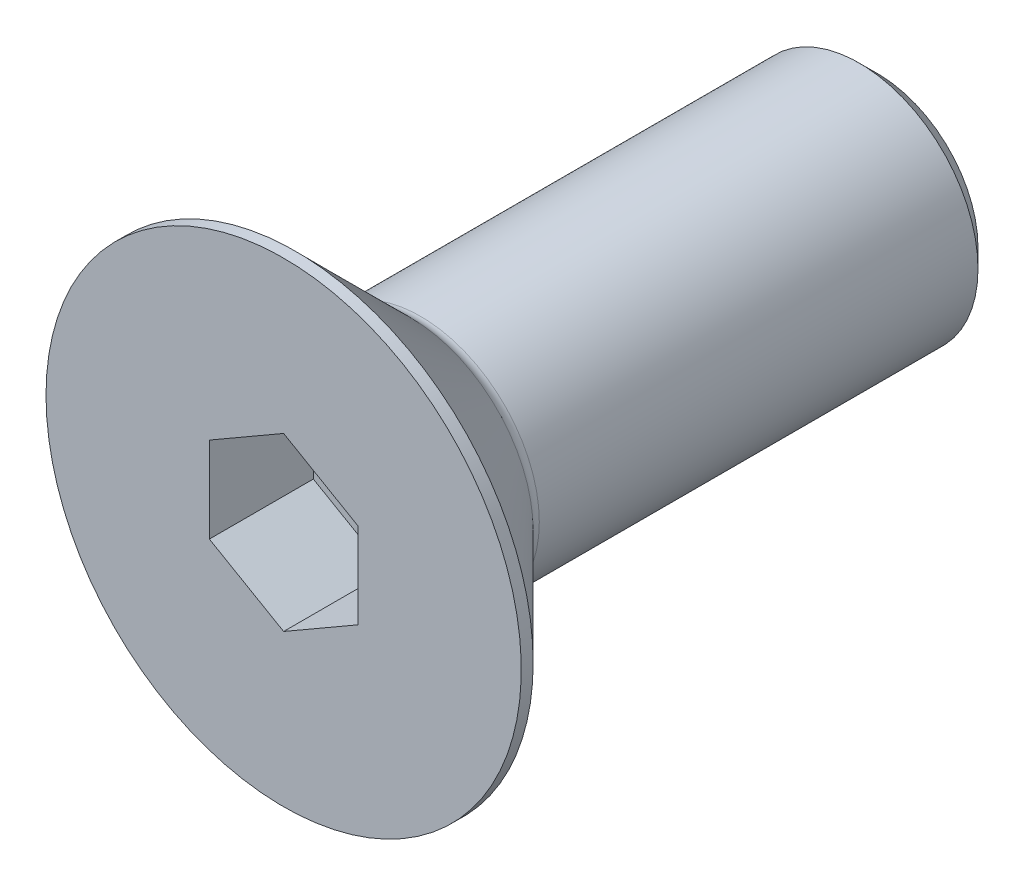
ISO-10303-21;
HEADER;
FILE_DESCRIPTION(('STEP AP214'),'2;1');
FILE_NAME('part.step','',(''),(''),'','','');
FILE_SCHEMA(('AUTOMOTIVE_DESIGN { 1 0 10303 214 1 1 1 1 }'));
ENDSEC;
DATA;
#1=APPLICATION_CONTEXT('core data for automotive mechanical design processes');
#2=APPLICATION_PROTOCOL_DEFINITION('international standard','automotive_design',2000,#1);
#3=PRODUCT_CONTEXT('',#1,'mechanical');
#4=PRODUCT('Part','Part','',(#3));
#5=PRODUCT_RELATED_PRODUCT_CATEGORY('part','',(#4));
#6=PRODUCT_DEFINITION_FORMATION('','',#4);
#7=PRODUCT_DEFINITION_CONTEXT('part definition',#1,'design');
#8=PRODUCT_DEFINITION('design','',#6,#7);
#9=PRODUCT_DEFINITION_SHAPE('','',#8);
#10=(LENGTH_UNIT() NAMED_UNIT(*) SI_UNIT(.MILLI.,.METRE.));
#11=(NAMED_UNIT(*) PLANE_ANGLE_UNIT() SI_UNIT($,.RADIAN.));
#12=(NAMED_UNIT(*) SI_UNIT($,.STERADIAN.) SOLID_ANGLE_UNIT());
#13=UNCERTAINTY_MEASURE_WITH_UNIT(LENGTH_MEASURE(1.E-05),#10,'distance_accuracy_value','');
#14=(GEOMETRIC_REPRESENTATION_CONTEXT(3) GLOBAL_UNCERTAINTY_ASSIGNED_CONTEXT((#13)) GLOBAL_UNIT_ASSIGNED_CONTEXT((#10,
#11,#12)) REPRESENTATION_CONTEXT('',''));
#15=CARTESIAN_POINT('',(0.,0.,0.));
#16=DIRECTION('',(0.,0.,1.));
#17=DIRECTION('',(1.,0.,0.));
#18=AXIS2_PLACEMENT_3D('',#15,#16,#17);
#19=CARTESIAN_POINT('',(0.,0.,-3.5));
#20=DIRECTION('',(0.,0.,1.));
#21=DIRECTION('',(1.,0.,0.));
#22=AXIS2_PLACEMENT_3D('',#19,#20,#21);
#23=PLANE('',#22);
#24=DIRECTION('',(-0.866025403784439,-0.5,0.));
#25=VECTOR('',#24,1.);
#26=CARTESIAN_POINT('',(0.,2.88675134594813,-3.5));
#27=LINE('',#26,#25);
#28=CARTESIAN_POINT('',(0.,2.88675134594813,-3.5));
#29=VERTEX_POINT('',#28);
#30=CARTESIAN_POINT('',(-2.5,1.44337567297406,-3.5));
#31=VERTEX_POINT('',#30);
#32=EDGE_CURVE('E83',#29,#31,#27,.T.);
#33=ORIENTED_EDGE('',*,*,#32,.T.);
#34=DIRECTION('',(0.,1.,0.));
#35=VECTOR('',#34,1.);
#36=CARTESIAN_POINT('',(-2.5,1.44337567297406,-3.5));
#37=LINE('',#36,#35);
#38=CARTESIAN_POINT('',(-2.5,-1.44337567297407,-3.5));
#39=VERTEX_POINT('',#38);
#40=EDGE_CURVE('E67',#31,#39,#37,.F.);
#41=ORIENTED_EDGE('',*,*,#40,.T.);
#42=DIRECTION('',(0.866025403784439,-0.499999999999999,0.));
#43=VECTOR('',#42,1.);
#44=CARTESIAN_POINT('',(-2.5,-1.44337567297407,-3.5));
#45=LINE('',#44,#43);
#46=CARTESIAN_POINT('',(0.,-2.88675134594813,-3.5));
#47=VERTEX_POINT('',#46);
#48=EDGE_CURVE('E72',#39,#47,#45,.T.);
#49=ORIENTED_EDGE('',*,*,#48,.T.);
#50=DIRECTION('',(0.866025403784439,0.5,0.));
#51=VECTOR('',#50,1.);
#52=CARTESIAN_POINT('',(0.,-2.88675134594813,-3.5));
#53=LINE('',#52,#51);
#54=CARTESIAN_POINT('',(2.5,-1.44337567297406,-3.5));
#55=VERTEX_POINT('',#54);
#56=EDGE_CURVE('E129',#47,#55,#53,.T.);
#57=ORIENTED_EDGE('',*,*,#56,.T.);
#58=DIRECTION('',(0.,1.,0.));
#59=VECTOR('',#58,1.);
#60=CARTESIAN_POINT('',(2.5,-1.44337567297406,-3.5));
#61=LINE('',#60,#59);
#62=CARTESIAN_POINT('',(2.5,1.44337567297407,-3.5));
#63=VERTEX_POINT('',#62);
#64=EDGE_CURVE('E133',#55,#63,#61,.T.);
#65=ORIENTED_EDGE('',*,*,#64,.T.);
#66=DIRECTION('',(-0.866025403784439,0.499999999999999,0.));
#67=VECTOR('',#66,1.);
#68=CARTESIAN_POINT('',(2.5,1.44337567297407,-3.5));
#69=LINE('',#68,#67);
#70=EDGE_CURVE('E138',#63,#29,#69,.T.);
#71=ORIENTED_EDGE('',*,*,#70,.T.);
#72=EDGE_LOOP('',(#33,#41,#49,#57,#65,#71));
#73=FACE_BOUND('',#72,.T.);
#74=ADVANCED_FACE('F16',(#73),#23,.T.);
#75=CARTESIAN_POINT('',(-2.5,-1.44337567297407,0.));
#76=DIRECTION('',(-0.499999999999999,-0.866025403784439,0.));
#77=DIRECTION('',(0.866025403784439,-0.499999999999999,0.));
#78=AXIS2_PLACEMENT_3D('',#75,#76,#77);
#79=PLANE('',#78);
#80=DIRECTION('',(0.,0.,1.));
#81=VECTOR('',#80,1.);
#82=CARTESIAN_POINT('',(-2.5,-1.44337567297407,0.));
#83=LINE('',#82,#81);
#84=CARTESIAN_POINT('',(-2.5,-1.44337567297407,0.));
#85=VERTEX_POINT('',#84);
#86=EDGE_CURVE('E74',#39,#85,#83,.T.);
#87=ORIENTED_EDGE('',*,*,#86,.T.);
#88=DIRECTION('',(-0.866025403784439,0.499999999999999,0.));
#89=VECTOR('',#88,1.);
#90=CARTESIAN_POINT('',(0.,-2.88675134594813,0.));
#91=LINE('',#90,#89);
#92=CARTESIAN_POINT('',(0.,-2.88675134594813,0.));
#93=VERTEX_POINT('',#92);
#94=EDGE_CURVE('E127',#93,#85,#91,.T.);
#95=ORIENTED_EDGE('',*,*,#94,.F.);
#96=DIRECTION('',(0.,0.,1.));
#97=VECTOR('',#96,1.);
#98=CARTESIAN_POINT('',(0.,-2.88675134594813,0.));
#99=LINE('',#98,#97);
#100=EDGE_CURVE('E77',#93,#47,#99,.F.);
#101=ORIENTED_EDGE('',*,*,#100,.T.);
#102=ORIENTED_EDGE('',*,*,#48,.F.);
#103=EDGE_LOOP('',(#87,#95,#101,#102));
#104=FACE_BOUND('',#103,.T.);
#105=ADVANCED_FACE('F73',(#104),#79,.F.);
#106=CARTESIAN_POINT('',(-2.5,1.44337567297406,0.));
#107=DIRECTION('',(-1.,0.,0.));
#108=DIRECTION('',(0.,0.,1.));
#109=AXIS2_PLACEMENT_3D('',#106,#107,#108);
#110=PLANE('',#109);
#111=DIRECTION('',(0.,0.,1.));
#112=VECTOR('',#111,1.);
#113=CARTESIAN_POINT('',(-2.5,1.44337567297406,0.));
#114=LINE('',#113,#112);
#115=CARTESIAN_POINT('',(-2.5,1.44337567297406,0.));
#116=VERTEX_POINT('',#115);
#117=EDGE_CURVE('E85',#31,#116,#114,.T.);
#118=ORIENTED_EDGE('',*,*,#117,.T.);
#119=DIRECTION('',(0.,1.,0.));
#120=VECTOR('',#119,1.);
#121=CARTESIAN_POINT('',(-2.5,0.,0.));
#122=LINE('',#121,#120);
#123=EDGE_CURVE('E89',#85,#116,#122,.T.);
#124=ORIENTED_EDGE('',*,*,#123,.F.);
#125=ORIENTED_EDGE('',*,*,#86,.F.);
#126=ORIENTED_EDGE('',*,*,#40,.F.);
#127=EDGE_LOOP('',(#118,#124,#125,#126));
#128=FACE_BOUND('',#127,.T.);
#129=ADVANCED_FACE('F87',(#128),#110,.F.);
#130=CARTESIAN_POINT('',(0.,2.88675134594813,0.));
#131=DIRECTION('',(-0.5,0.866025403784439,0.));
#132=DIRECTION('',(-0.866025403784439,-0.5,0.));
#133=AXIS2_PLACEMENT_3D('',#130,#131,#132);
#134=PLANE('',#133);
#135=DIRECTION('',(0.,0.,1.));
#136=VECTOR('',#135,1.);
#137=CARTESIAN_POINT('',(0.,2.88675134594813,0.));
#138=LINE('',#137,#136);
#139=CARTESIAN_POINT('',(0.,2.88675134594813,0.));
#140=VERTEX_POINT('',#139);
#141=EDGE_CURVE('E140',#29,#140,#138,.T.);
#142=ORIENTED_EDGE('',*,*,#141,.T.);
#143=DIRECTION('',(0.866025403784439,0.499999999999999,0.));
#144=VECTOR('',#143,1.);
#145=CARTESIAN_POINT('',(-2.5,1.44337567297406,0.));
#146=LINE('',#145,#144);
#147=EDGE_CURVE('E123',#116,#140,#146,.T.);
#148=ORIENTED_EDGE('',*,*,#147,.F.);
#149=ORIENTED_EDGE('',*,*,#117,.F.);
#150=ORIENTED_EDGE('',*,*,#32,.F.);
#151=EDGE_LOOP('',(#142,#148,#149,#150));
#152=FACE_BOUND('',#151,.T.);
#153=ADVANCED_FACE('F144',(#152),#134,.F.);
#154=CARTESIAN_POINT('',(2.5,1.44337567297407,0.));
#155=DIRECTION('',(0.499999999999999,0.866025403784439,0.));
#156=DIRECTION('',(-0.866025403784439,0.499999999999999,0.));
#157=AXIS2_PLACEMENT_3D('',#154,#155,#156);
#158=PLANE('',#157);
#159=DIRECTION('',(0.,0.,-1.));
#160=VECTOR('',#159,1.);
#161=CARTESIAN_POINT('',(2.5,1.44337567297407,0.));
#162=LINE('',#161,#160);
#163=CARTESIAN_POINT('',(2.5,1.44337567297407,0.));
#164=VERTEX_POINT('',#163);
#165=EDGE_CURVE('E136',#63,#164,#162,.F.);
#166=ORIENTED_EDGE('',*,*,#165,.T.);
#167=DIRECTION('',(0.866025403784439,-0.499999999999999,0.));
#168=VECTOR('',#167,1.);
#169=CARTESIAN_POINT('',(0.,2.88675134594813,0.));
#170=LINE('',#169,#168);
#171=EDGE_CURVE('E120',#140,#164,#170,.T.);
#172=ORIENTED_EDGE('',*,*,#171,.F.);
#173=ORIENTED_EDGE('',*,*,#141,.F.);
#174=ORIENTED_EDGE('',*,*,#70,.F.);
#175=EDGE_LOOP('',(#166,#172,#173,#174));
#176=FACE_BOUND('',#175,.T.);
#177=ADVANCED_FACE('F155',(#176),#158,.F.);
#178=CARTESIAN_POINT('',(2.5,-1.44337567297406,0.));
#179=DIRECTION('',(1.,0.,0.));
#180=DIRECTION('',(0.,0.,-1.));
#181=AXIS2_PLACEMENT_3D('',#178,#179,#180);
#182=PLANE('',#181);
#183=DIRECTION('',(0.,0.,1.));
#184=VECTOR('',#183,1.);
#185=CARTESIAN_POINT('',(2.5,-1.44337567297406,0.));
#186=LINE('',#185,#184);
#187=CARTESIAN_POINT('',(2.5,-1.44337567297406,0.));
#188=VERTEX_POINT('',#187);
#189=EDGE_CURVE('E35',#55,#188,#186,.T.);
#190=ORIENTED_EDGE('',*,*,#189,.T.);
#191=DIRECTION('',(0.,1.,0.));
#192=VECTOR('',#191,1.);
#193=CARTESIAN_POINT('',(2.5,0.,0.));
#194=LINE('',#193,#192);
#195=EDGE_CURVE('E117',#164,#188,#194,.F.);
#196=ORIENTED_EDGE('',*,*,#195,.F.);
#197=ORIENTED_EDGE('',*,*,#165,.F.);
#198=ORIENTED_EDGE('',*,*,#64,.F.);
#199=EDGE_LOOP('',(#190,#196,#197,#198));
#200=FACE_BOUND('',#199,.T.);
#201=ADVANCED_FACE('F153',(#200),#182,.F.);
#202=CARTESIAN_POINT('',(0.,-2.88675134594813,0.));
#203=DIRECTION('',(0.5,-0.866025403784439,0.));
#204=DIRECTION('',(0.866025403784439,0.5,0.));
#205=AXIS2_PLACEMENT_3D('',#202,#203,#204);
#206=PLANE('',#205);
#207=ORIENTED_EDGE('',*,*,#100,.F.);
#208=DIRECTION('',(-0.866025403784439,-0.499999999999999,0.));
#209=VECTOR('',#208,1.);
#210=CARTESIAN_POINT('',(2.5,-1.44337567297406,0.));
#211=LINE('',#210,#209);
#212=EDGE_CURVE('E114',#188,#93,#211,.T.);
#213=ORIENTED_EDGE('',*,*,#212,.F.);
#214=ORIENTED_EDGE('',*,*,#189,.F.);
#215=ORIENTED_EDGE('',*,*,#56,.F.);
#216=EDGE_LOOP('',(#207,#213,#214,#215));
#217=FACE_BOUND('',#216,.T.);
#218=ADVANCED_FACE('F151',(#217),#206,.F.);
#219=CARTESIAN_POINT('',(4.,0.,0.));
#220=DIRECTION('',(0.,0.,1.));
#221=DIRECTION('',(1.,0.,0.));
#222=AXIS2_PLACEMENT_3D('',#219,#220,#221);
#223=PLANE('',#222);
#224=ORIENTED_EDGE('',*,*,#195,.T.);
#225=ORIENTED_EDGE('',*,*,#212,.T.);
#226=ORIENTED_EDGE('',*,*,#94,.T.);
#227=ORIENTED_EDGE('',*,*,#123,.T.);
#228=ORIENTED_EDGE('',*,*,#147,.T.);
#229=ORIENTED_EDGE('',*,*,#171,.T.);
#230=EDGE_LOOP('',(#224,#225,#226,#227,#228,#229));
#231=FACE_BOUND('',#230,.T.);
#232=CARTESIAN_POINT('',(0.,0.,0.));
#233=DIRECTION('',(0.,0.,-1.));
#234=DIRECTION('',(-1.,0.,0.));
#235=AXIS2_PLACEMENT_3D('',#232,#233,#234);
#236=CIRCLE('',#235,8.);
#237=CARTESIAN_POINT('',(-8.,0.,0.));
#238=VERTEX_POINT('',#237);
#239=EDGE_CURVE('E20',#238,#238,#236,.T.);
#240=ORIENTED_EDGE('',*,*,#239,.F.);
#241=EDGE_LOOP('',(#240));
#242=FACE_BOUND('',#241,.T.);
#243=ADVANCED_FACE('F148',(#231,#242),#223,.T.);
#244=CARTESIAN_POINT('',(0.,0.,-0.2));
#245=DIRECTION('',(0.,0.,-1.));
#246=DIRECTION('',(-1.,0.,0.));
#247=AXIS2_PLACEMENT_3D('',#244,#245,#246);
#248=CYLINDRICAL_SURFACE('',#247,8.);
#249=ORIENTED_EDGE('',*,*,#239,.T.);
#250=EDGE_LOOP('',(#249));
#251=FACE_BOUND('',#250,.T.);
#252=CARTESIAN_POINT('',(0.,0.,-0.399999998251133));
#253=DIRECTION('',(0.,0.,1.));
#254=DIRECTION('',(1.,0.,0.));
#255=AXIS2_PLACEMENT_3D('',#252,#253,#254);
#256=CIRCLE('',#255,7.99999999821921);
#257=CARTESIAN_POINT('',(7.99999999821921,0.,-0.399999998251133));
#258=VERTEX_POINT('',#257);
#259=EDGE_CURVE('E101',#258,#258,#256,.F.);
#260=ORIENTED_EDGE('',*,*,#259,.F.);
#261=EDGE_LOOP('',(#260));
#262=FACE_BOUND('',#261,.T.);
#263=ADVANCED_FACE('F184',(#251,#262),#248,.T.);
#264=CARTESIAN_POINT('',(0.,0.,-0.399999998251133));
#265=DIRECTION('',(0.,0.,1.));
#266=DIRECTION('',(1.,0.,0.));
#267=AXIS2_PLACEMENT_3D('',#264,#265,#266);
#268=CONICAL_SURFACE('',#267,7.99999999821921,0.785398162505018);
#269=CARTESIAN_POINT('',(0.,0.,-4.25355339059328));
#270=DIRECTION('',(0.,0.,-1.));
#271=DIRECTION('',(0.,1.,0.));
#272=AXIS2_PLACEMENT_3D('',#269,#270,#271);
#273=CIRCLE('',#272,4.14644660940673);
#274=CARTESIAN_POINT('',(0.,4.14644660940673,-4.25355339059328));
#275=VERTEX_POINT('',#274);
#276=EDGE_CURVE('E95',#275,#275,#273,.T.);
#277=ORIENTED_EDGE('',*,*,#276,.F.);
#278=EDGE_LOOP('',(#277));
#279=FACE_BOUND('',#278,.T.);
#280=ORIENTED_EDGE('',*,*,#259,.T.);
#281=EDGE_LOOP('',(#280));
#282=FACE_BOUND('',#281,.T.);
#283=ADVANCED_FACE('F180',(#279,#282),#268,.T.);
#284=CARTESIAN_POINT('',(2.,0.,-20.));
#285=DIRECTION('',(0.,0.,-1.));
#286=DIRECTION('',(-1.,0.,0.));
#287=AXIS2_PLACEMENT_3D('',#284,#285,#286);
#288=PLANE('',#287);
#289=CARTESIAN_POINT('',(0.,0.,-20.000000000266));
#290=DIRECTION('',(0.,0.,1.));
#291=DIRECTION('',(1.,0.,0.));
#292=AXIS2_PLACEMENT_3D('',#289,#290,#291);
#293=CIRCLE('',#292,3.37500000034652);
#294=CARTESIAN_POINT('',(3.37500000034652,0.,-20.000000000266));
#295=VERTEX_POINT('',#294);
#296=EDGE_CURVE('E93',#295,#295,#293,.T.);
#297=ORIENTED_EDGE('',*,*,#296,.F.);
#298=EDGE_LOOP('',(#297));
#299=FACE_BOUND('',#298,.T.);
#300=ADVANCED_FACE('F177',(#299),#288,.T.);
#301=CARTESIAN_POINT('',(0.,0.,-4.60710678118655));
#302=DIRECTION('',(0.,0.,-1.));
#303=DIRECTION('',(-1.,0.,0.));
#304=AXIS2_PLACEMENT_3D('',#301,#302,#303);
#305=TOROIDAL_SURFACE('',#304,4.5,0.5);
#306=CARTESIAN_POINT('',(0.,0.,-4.60710678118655));
#307=DIRECTION('',(0.,0.,-1.));
#308=DIRECTION('',(-1.,0.,0.));
#309=AXIS2_PLACEMENT_3D('',#306,#307,#308);
#310=CIRCLE('',#309,4.);
#311=CARTESIAN_POINT('',(-4.,0.,-4.60710678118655));
#312=VERTEX_POINT('',#311);
#313=EDGE_CURVE('E26',#312,#312,#310,.T.);
#314=ORIENTED_EDGE('',*,*,#313,.F.);
#315=EDGE_LOOP('',(#314));
#316=FACE_BOUND('',#315,.T.);
#317=ORIENTED_EDGE('',*,*,#276,.T.);
#318=EDGE_LOOP('',(#317));
#319=FACE_BOUND('',#318,.T.);
#320=ADVANCED_FACE('F18',(#316,#319),#305,.F.);
#321=CARTESIAN_POINT('',(0.,0.,-19.3749999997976));
#322=DIRECTION('',(0.,0.,1.));
#323=DIRECTION('',(1.,0.,0.));
#324=AXIS2_PLACEMENT_3D('',#321,#322,#323);
#325=CONICAL_SURFACE('',#324,3.99999999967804,0.785398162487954);
#326=ORIENTED_EDGE('',*,*,#296,.T.);
#327=EDGE_LOOP('',(#326));
#328=FACE_BOUND('',#327,.T.);
#329=CARTESIAN_POINT('',(0.,0.,-19.375));
#330=DIRECTION('',(0.,0.,-1.));
#331=DIRECTION('',(-1.,0.,0.));
#332=AXIS2_PLACEMENT_3D('',#329,#330,#331);
#333=CIRCLE('',#332,4.);
#334=CARTESIAN_POINT('',(-4.,0.,-19.375));
#335=VERTEX_POINT('',#334);
#336=EDGE_CURVE('E11',#335,#335,#333,.F.);
#337=ORIENTED_EDGE('',*,*,#336,.F.);
#338=EDGE_LOOP('',(#337));
#339=FACE_BOUND('',#338,.T.);
#340=ADVANCED_FACE('F167',(#328,#339),#325,.T.);
#341=CARTESIAN_POINT('',(0.,0.,-12.2));
#342=DIRECTION('',(0.,0.,-1.));
#343=DIRECTION('',(-1.,0.,0.));
#344=AXIS2_PLACEMENT_3D('',#341,#342,#343);
#345=CYLINDRICAL_SURFACE('',#344,4.);
#346=ORIENTED_EDGE('',*,*,#336,.T.);
#347=EDGE_LOOP('',(#346));
#348=FACE_BOUND('',#347,.T.);
#349=ORIENTED_EDGE('',*,*,#313,.T.);
#350=EDGE_LOOP('',(#349));
#351=FACE_BOUND('',#350,.T.);
#352=ADVANCED_FACE('F165',(#348,#351),#345,.T.);
#353=CLOSED_SHELL('',(#74,#105,#129,#153,#177,#201,#218,#243,#263,#283,#300,#320,#340,#352));
#354=MANIFOLD_SOLID_BREP('B1',#353);
#355=ADVANCED_BREP_SHAPE_REPRESENTATION('',(#18,#354),#14);
#356=SHAPE_DEFINITION_REPRESENTATION(#9,#355);
ENDSEC;
END-ISO-10303-21;
